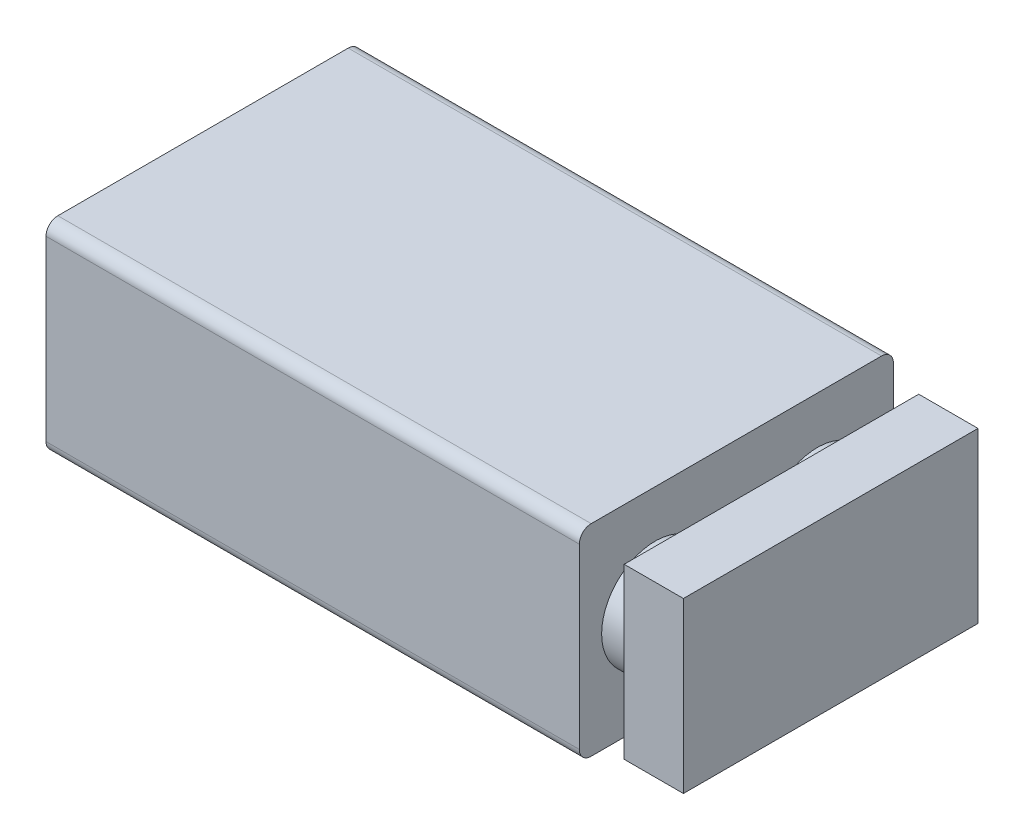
ISO-10303-21;
HEADER;
FILE_DESCRIPTION(('STEP AP214'),'2;1');
FILE_NAME('part.step','',(''),(''),'','','');
FILE_SCHEMA(('AUTOMOTIVE_DESIGN { 1 0 10303 214 1 1 1 1 }'));
ENDSEC;
DATA;
#1=APPLICATION_CONTEXT('core data for automotive mechanical design processes');
#2=APPLICATION_PROTOCOL_DEFINITION('international standard','automotive_design',2000,#1);
#3=PRODUCT_CONTEXT('',#1,'mechanical');
#4=PRODUCT('Part','Part','',(#3));
#5=PRODUCT_RELATED_PRODUCT_CATEGORY('part','',(#4));
#6=PRODUCT_DEFINITION_FORMATION('','',#4);
#7=PRODUCT_DEFINITION_CONTEXT('part definition',#1,'design');
#8=PRODUCT_DEFINITION('design','',#6,#7);
#9=PRODUCT_DEFINITION_SHAPE('','',#8);
#10=(LENGTH_UNIT() NAMED_UNIT(*) SI_UNIT(.MILLI.,.METRE.));
#11=(NAMED_UNIT(*) PLANE_ANGLE_UNIT() SI_UNIT($,.RADIAN.));
#12=(NAMED_UNIT(*) SI_UNIT($,.STERADIAN.) SOLID_ANGLE_UNIT());
#13=UNCERTAINTY_MEASURE_WITH_UNIT(LENGTH_MEASURE(1.E-05),#10,'distance_accuracy_value','');
#14=(GEOMETRIC_REPRESENTATION_CONTEXT(3) GLOBAL_UNCERTAINTY_ASSIGNED_CONTEXT((#13)) GLOBAL_UNIT_ASSIGNED_CONTEXT((#10,
#11,#12)) REPRESENTATION_CONTEXT('',''));
#15=CARTESIAN_POINT('',(0.,0.,0.));
#16=DIRECTION('',(0.,0.,1.));
#17=DIRECTION('',(1.,0.,0.));
#18=AXIS2_PLACEMENT_3D('',#15,#16,#17);
#19=CARTESIAN_POINT('',(0.,0.,26.5));
#20=DIRECTION('',(1.,0.,0.));
#21=DIRECTION('',(0.,0.,-1.));
#22=AXIS2_PLACEMENT_3D('',#19,#20,#21);
#23=PLANE('',#22);
#24=DIRECTION('',(0.,0.,-1.));
#25=VECTOR('',#24,1.);
#26=CARTESIAN_POINT('',(0.,17.,26.5));
#27=LINE('',#26,#25);
#28=CARTESIAN_POINT('',(0.,17.,25.5));
#29=VERTEX_POINT('',#28);
#30=CARTESIAN_POINT('',(0.,17.,1.));
#31=VERTEX_POINT('',#30);
#32=EDGE_CURVE('E168',#29,#31,#27,.T.);
#33=ORIENTED_EDGE('',*,*,#32,.T.);
#34=CARTESIAN_POINT('',(0.,16.,1.));
#35=DIRECTION('',(1.,0.,0.));
#36=DIRECTION('',(0.,0.,-1.));
#37=AXIS2_PLACEMENT_3D('',#34,#35,#36);
#38=CIRCLE('',#37,1.);
#39=CARTESIAN_POINT('',(0.,16.,0.));
#40=VERTEX_POINT('',#39);
#41=EDGE_CURVE('E200',#31,#40,#38,.F.);
#42=ORIENTED_EDGE('',*,*,#41,.T.);
#43=DIRECTION('',(0.,-1.,0.));
#44=VECTOR('',#43,1.);
#45=CARTESIAN_POINT('',(0.,0.,0.));
#46=LINE('',#45,#44);
#47=CARTESIAN_POINT('',(0.,1.,0.));
#48=VERTEX_POINT('',#47);
#49=EDGE_CURVE('E160',#40,#48,#46,.T.);
#50=ORIENTED_EDGE('',*,*,#49,.T.);
#51=CARTESIAN_POINT('',(0.,1.,1.));
#52=DIRECTION('',(1.,0.,0.));
#53=DIRECTION('',(0.,0.,-1.));
#54=AXIS2_PLACEMENT_3D('',#51,#52,#53);
#55=CIRCLE('',#54,1.);
#56=CARTESIAN_POINT('',(0.,0.,1.));
#57=VERTEX_POINT('',#56);
#58=EDGE_CURVE('E198',#48,#57,#55,.F.);
#59=ORIENTED_EDGE('',*,*,#58,.T.);
#60=DIRECTION('',(0.,0.,-1.));
#61=VECTOR('',#60,1.);
#62=CARTESIAN_POINT('',(0.,0.,26.5));
#63=LINE('',#62,#61);
#64=CARTESIAN_POINT('',(0.,0.,25.5));
#65=VERTEX_POINT('',#64);
#66=EDGE_CURVE('E180',#65,#57,#63,.T.);
#67=ORIENTED_EDGE('',*,*,#66,.F.);
#68=CARTESIAN_POINT('',(0.,1.,25.5));
#69=DIRECTION('',(1.,0.,0.));
#70=DIRECTION('',(0.,0.,-1.));
#71=AXIS2_PLACEMENT_3D('',#68,#69,#70);
#72=CIRCLE('',#71,1.);
#73=CARTESIAN_POINT('',(0.,1.,26.5));
#74=VERTEX_POINT('',#73);
#75=EDGE_CURVE('E194',#65,#74,#72,.F.);
#76=ORIENTED_EDGE('',*,*,#75,.T.);
#77=DIRECTION('',(0.,-1.,0.));
#78=VECTOR('',#77,1.);
#79=CARTESIAN_POINT('',(0.,0.,26.5));
#80=LINE('',#79,#78);
#81=CARTESIAN_POINT('',(0.,16.,26.5));
#82=VERTEX_POINT('',#81);
#83=EDGE_CURVE('E161',#82,#74,#80,.T.);
#84=ORIENTED_EDGE('',*,*,#83,.F.);
#85=CARTESIAN_POINT('',(0.,16.,25.5));
#86=DIRECTION('',(1.,0.,0.));
#87=DIRECTION('',(0.,0.,-1.));
#88=AXIS2_PLACEMENT_3D('',#85,#86,#87);
#89=CIRCLE('',#88,1.);
#90=EDGE_CURVE('E196',#82,#29,#89,.F.);
#91=ORIENTED_EDGE('',*,*,#90,.T.);
#92=EDGE_LOOP('',(#33,#42,#50,#59,#67,#76,#84,#91));
#93=FACE_BOUND('',#92,.T.);
#94=ADVANCED_FACE('F33',(#93),#23,.F.);
#95=CARTESIAN_POINT('',(0.,0.,26.5));
#96=DIRECTION('',(0.,1.,0.));
#97=DIRECTION('',(0.,0.,1.));
#98=AXIS2_PLACEMENT_3D('',#95,#96,#97);
#99=PLANE('',#98);
#100=ORIENTED_EDGE('',*,*,#66,.T.);
#101=DIRECTION('',(1.,0.,0.));
#102=VECTOR('',#101,1.);
#103=CARTESIAN_POINT('',(45.,0.,1.));
#104=LINE('',#103,#102);
#105=CARTESIAN_POINT('',(45.,0.,1.));
#106=VERTEX_POINT('',#105);
#107=EDGE_CURVE('E214',#57,#106,#104,.T.);
#108=ORIENTED_EDGE('',*,*,#107,.T.);
#109=DIRECTION('',(0.,0.,-1.));
#110=VECTOR('',#109,1.);
#111=CARTESIAN_POINT('',(45.,0.,26.5));
#112=LINE('',#111,#110);
#113=CARTESIAN_POINT('',(45.,0.,25.5));
#114=VERTEX_POINT('',#113);
#115=EDGE_CURVE('E178',#114,#106,#112,.T.);
#116=ORIENTED_EDGE('',*,*,#115,.F.);
#117=DIRECTION('',(1.,0.,0.));
#118=VECTOR('',#117,1.);
#119=CARTESIAN_POINT('',(0.,0.,25.5));
#120=LINE('',#119,#118);
#121=EDGE_CURVE('E212',#114,#65,#120,.F.);
#122=ORIENTED_EDGE('',*,*,#121,.T.);
#123=EDGE_LOOP('',(#100,#108,#116,#122));
#124=FACE_BOUND('',#123,.T.);
#125=ADVANCED_FACE('F234',(#124),#99,.F.);
#126=CARTESIAN_POINT('',(45.,0.,26.5));
#127=DIRECTION('',(-1.,0.,0.));
#128=DIRECTION('',(0.,0.,1.));
#129=AXIS2_PLACEMENT_3D('',#126,#127,#128);
#130=PLANE('',#129);
#131=CARTESIAN_POINT('',(45.,8.5,6.40499226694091));
#132=DIRECTION('',(-1.,0.,0.));
#133=DIRECTION('',(0.,0.,1.));
#134=AXIS2_PLACEMENT_3D('',#131,#132,#133);
#135=CIRCLE('',#134,4.52298364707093);
#136=CARTESIAN_POINT('',(45.,8.5,10.9279759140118));
#137=VERTEX_POINT('',#136);
#138=EDGE_CURVE('E186',#137,#137,#135,.F.);
#139=ORIENTED_EDGE('',*,*,#138,.F.);
#140=EDGE_LOOP('',(#139));
#141=FACE_BOUND('',#140,.T.);
#142=CARTESIAN_POINT('',(45.,8.5,20.0950077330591));
#143=DIRECTION('',(-1.,0.,0.));
#144=DIRECTION('',(0.,0.,1.));
#145=AXIS2_PLACEMENT_3D('',#142,#143,#144);
#146=CIRCLE('',#145,4.52298364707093);
#147=CARTESIAN_POINT('',(45.,8.5,24.61799138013));
#148=VERTEX_POINT('',#147);
#149=EDGE_CURVE('E183',#148,#148,#146,.F.);
#150=ORIENTED_EDGE('',*,*,#149,.F.);
#151=EDGE_LOOP('',(#150));
#152=FACE_BOUND('',#151,.T.);
#153=DIRECTION('',(0.,1.,0.));
#154=VECTOR('',#153,1.);
#155=CARTESIAN_POINT('',(45.,0.,0.));
#156=LINE('',#155,#154);
#157=CARTESIAN_POINT('',(45.,1.,0.));
#158=VERTEX_POINT('',#157);
#159=CARTESIAN_POINT('',(45.,16.,0.));
#160=VERTEX_POINT('',#159);
#161=EDGE_CURVE('E165',#158,#160,#156,.T.);
#162=ORIENTED_EDGE('',*,*,#161,.T.);
#163=CARTESIAN_POINT('',(45.,16.,1.));
#164=DIRECTION('',(-1.,0.,0.));
#165=DIRECTION('',(0.,0.,1.));
#166=AXIS2_PLACEMENT_3D('',#163,#164,#165);
#167=CIRCLE('',#166,1.);
#168=CARTESIAN_POINT('',(45.,17.,1.));
#169=VERTEX_POINT('',#168);
#170=EDGE_CURVE('E210',#160,#169,#167,.F.);
#171=ORIENTED_EDGE('',*,*,#170,.T.);
#172=DIRECTION('',(0.,0.,-1.));
#173=VECTOR('',#172,1.);
#174=CARTESIAN_POINT('',(45.,17.,26.5));
#175=LINE('',#174,#173);
#176=CARTESIAN_POINT('',(45.,17.,25.5));
#177=VERTEX_POINT('',#176);
#178=EDGE_CURVE('E175',#177,#169,#175,.T.);
#179=ORIENTED_EDGE('',*,*,#178,.F.);
#180=CARTESIAN_POINT('',(45.,16.,25.5));
#181=DIRECTION('',(-1.,0.,0.));
#182=DIRECTION('',(0.,0.,1.));
#183=AXIS2_PLACEMENT_3D('',#180,#181,#182);
#184=CIRCLE('',#183,1.);
#185=CARTESIAN_POINT('',(45.,16.,26.5));
#186=VERTEX_POINT('',#185);
#187=EDGE_CURVE('E207',#177,#186,#184,.F.);
#188=ORIENTED_EDGE('',*,*,#187,.T.);
#189=DIRECTION('',(0.,1.,0.));
#190=VECTOR('',#189,1.);
#191=CARTESIAN_POINT('',(45.,0.,26.5));
#192=LINE('',#191,#190);
#193=CARTESIAN_POINT('',(45.,1.,26.5));
#194=VERTEX_POINT('',#193);
#195=EDGE_CURVE('E164',#194,#186,#192,.T.);
#196=ORIENTED_EDGE('',*,*,#195,.F.);
#197=CARTESIAN_POINT('',(45.,1.,25.5));
#198=DIRECTION('',(-1.,0.,0.));
#199=DIRECTION('',(0.,0.,1.));
#200=AXIS2_PLACEMENT_3D('',#197,#198,#199);
#201=CIRCLE('',#200,1.);
#202=EDGE_CURVE('E56',#194,#114,#201,.F.);
#203=ORIENTED_EDGE('',*,*,#202,.T.);
#204=ORIENTED_EDGE('',*,*,#115,.T.);
#205=CARTESIAN_POINT('',(45.,1.,1.));
#206=DIRECTION('',(-1.,0.,0.));
#207=DIRECTION('',(0.,0.,1.));
#208=AXIS2_PLACEMENT_3D('',#205,#206,#207);
#209=CIRCLE('',#208,1.);
#210=EDGE_CURVE('E48',#106,#158,#209,.F.);
#211=ORIENTED_EDGE('',*,*,#210,.T.);
#212=EDGE_LOOP('',(#162,#171,#179,#188,#196,#203,#204,#211));
#213=FACE_BOUND('',#212,.T.);
#214=ADVANCED_FACE('F223',(#141,#152,#213),#130,.F.);
#215=CARTESIAN_POINT('',(0.,17.,26.5));
#216=DIRECTION('',(0.,-1.,0.));
#217=DIRECTION('',(0.,0.,-1.));
#218=AXIS2_PLACEMENT_3D('',#215,#216,#217);
#219=PLANE('',#218);
#220=ORIENTED_EDGE('',*,*,#178,.T.);
#221=DIRECTION('',(-1.,0.,0.));
#222=VECTOR('',#221,1.);
#223=CARTESIAN_POINT('',(0.,17.,1.));
#224=LINE('',#223,#222);
#225=EDGE_CURVE('E191',#169,#31,#224,.T.);
#226=ORIENTED_EDGE('',*,*,#225,.T.);
#227=ORIENTED_EDGE('',*,*,#32,.F.);
#228=DIRECTION('',(-1.,0.,0.));
#229=VECTOR('',#228,1.);
#230=CARTESIAN_POINT('',(0.,17.,25.5));
#231=LINE('',#230,#229);
#232=EDGE_CURVE('E189',#29,#177,#231,.F.);
#233=ORIENTED_EDGE('',*,*,#232,.T.);
#234=EDGE_LOOP('',(#220,#226,#227,#233));
#235=FACE_BOUND('',#234,.T.);
#236=ADVANCED_FACE('F247',(#235),#219,.F.);
#237=CARTESIAN_POINT('',(0.,0.,26.5));
#238=DIRECTION('',(0.,0.,-1.));
#239=DIRECTION('',(-1.,0.,0.));
#240=AXIS2_PLACEMENT_3D('',#237,#238,#239);
#241=PLANE('',#240);
#242=ORIENTED_EDGE('',*,*,#195,.T.);
#243=DIRECTION('',(-1.,0.,0.));
#244=VECTOR('',#243,1.);
#245=CARTESIAN_POINT('',(0.,16.,26.5));
#246=LINE('',#245,#244);
#247=EDGE_CURVE('E11',#186,#82,#246,.T.);
#248=ORIENTED_EDGE('',*,*,#247,.T.);
#249=ORIENTED_EDGE('',*,*,#83,.T.);
#250=DIRECTION('',(1.,0.,0.));
#251=VECTOR('',#250,1.);
#252=CARTESIAN_POINT('',(0.,1.,26.5));
#253=LINE('',#252,#251);
#254=EDGE_CURVE('E41',#74,#194,#253,.T.);
#255=ORIENTED_EDGE('',*,*,#254,.T.);
#256=EDGE_LOOP('',(#242,#248,#249,#255));
#257=FACE_BOUND('',#256,.T.);
#258=ADVANCED_FACE('F218',(#257),#241,.F.);
#259=CARTESIAN_POINT('',(0.,0.,0.));
#260=DIRECTION('',(0.,0.,-1.));
#261=DIRECTION('',(-1.,0.,0.));
#262=AXIS2_PLACEMENT_3D('',#259,#260,#261);
#263=PLANE('',#262);
#264=ORIENTED_EDGE('',*,*,#49,.F.);
#265=DIRECTION('',(-1.,0.,0.));
#266=VECTOR('',#265,1.);
#267=CARTESIAN_POINT('',(45.,16.,0.));
#268=LINE('',#267,#266);
#269=EDGE_CURVE('E204',#40,#160,#268,.F.);
#270=ORIENTED_EDGE('',*,*,#269,.T.);
#271=ORIENTED_EDGE('',*,*,#161,.F.);
#272=DIRECTION('',(1.,0.,0.));
#273=VECTOR('',#272,1.);
#274=CARTESIAN_POINT('',(0.,1.,0.));
#275=LINE('',#274,#273);
#276=EDGE_CURVE('E202',#158,#48,#275,.F.);
#277=ORIENTED_EDGE('',*,*,#276,.T.);
#278=EDGE_LOOP('',(#264,#270,#271,#277));
#279=FACE_BOUND('',#278,.T.);
#280=ADVANCED_FACE('F239',(#279),#263,.T.);
#281=CARTESIAN_POINT('',(48.,8.5,20.0950077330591));
#282=DIRECTION('',(-1.,0.,0.));
#283=DIRECTION('',(0.,0.,1.));
#284=AXIS2_PLACEMENT_3D('',#281,#282,#283);
#285=CYLINDRICAL_SURFACE('',#284,4.52298364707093);
#286=CARTESIAN_POINT('',(48.,8.5,20.0950077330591));
#287=DIRECTION('',(1.,0.,0.));
#288=DIRECTION('',(0.,0.,-1.));
#289=AXIS2_PLACEMENT_3D('',#286,#287,#288);
#290=CIRCLE('',#289,4.52298364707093);
#291=CARTESIAN_POINT('',(48.,8.5,15.5720240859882));
#292=VERTEX_POINT('',#291);
#293=EDGE_CURVE('E152',#292,#292,#290,.T.);
#294=ORIENTED_EDGE('',*,*,#293,.F.);
#295=EDGE_LOOP('',(#294));
#296=FACE_BOUND('',#295,.T.);
#297=ORIENTED_EDGE('',*,*,#149,.T.);
#298=EDGE_LOOP('',(#297));
#299=FACE_BOUND('',#298,.T.);
#300=ADVANCED_FACE('F287',(#296,#299),#285,.T.);
#301=CARTESIAN_POINT('',(48.,8.5,6.40499226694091));
#302=DIRECTION('',(-1.,0.,0.));
#303=DIRECTION('',(0.,0.,1.));
#304=AXIS2_PLACEMENT_3D('',#301,#302,#303);
#305=CYLINDRICAL_SURFACE('',#304,4.52298364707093);
#306=CARTESIAN_POINT('',(48.,8.5,6.40499226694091));
#307=DIRECTION('',(1.,0.,0.));
#308=DIRECTION('',(0.,0.,1.));
#309=AXIS2_PLACEMENT_3D('',#306,#307,#308);
#310=CIRCLE('',#309,4.52298364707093);
#311=CARTESIAN_POINT('',(48.,8.5,10.9279759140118));
#312=VERTEX_POINT('',#311);
#313=EDGE_CURVE('E149',#312,#312,#310,.T.);
#314=ORIENTED_EDGE('',*,*,#313,.F.);
#315=EDGE_LOOP('',(#314));
#316=FACE_BOUND('',#315,.T.);
#317=ORIENTED_EDGE('',*,*,#138,.T.);
#318=EDGE_LOOP('',(#317));
#319=FACE_BOUND('',#318,.T.);
#320=ADVANCED_FACE('F268',(#316,#319),#305,.T.);
#321=CARTESIAN_POINT('',(0.,16.,1.));
#322=DIRECTION('',(1.,0.,0.));
#323=DIRECTION('',(0.,0.,-1.));
#324=AXIS2_PLACEMENT_3D('',#321,#322,#323);
#325=CYLINDRICAL_SURFACE('',#324,1.);
#326=ORIENTED_EDGE('',*,*,#170,.F.);
#327=ORIENTED_EDGE('',*,*,#269,.F.);
#328=ORIENTED_EDGE('',*,*,#41,.F.);
#329=ORIENTED_EDGE('',*,*,#225,.F.);
#330=EDGE_LOOP('',(#326,#327,#328,#329));
#331=FACE_BOUND('',#330,.T.);
#332=ADVANCED_FACE('F244',(#331),#325,.T.);
#333=CARTESIAN_POINT('',(0.,1.,1.));
#334=DIRECTION('',(-1.,0.,0.));
#335=DIRECTION('',(0.,0.,1.));
#336=AXIS2_PLACEMENT_3D('',#333,#334,#335);
#337=CYLINDRICAL_SURFACE('',#336,1.);
#338=ORIENTED_EDGE('',*,*,#58,.F.);
#339=ORIENTED_EDGE('',*,*,#276,.F.);
#340=ORIENTED_EDGE('',*,*,#210,.F.);
#341=ORIENTED_EDGE('',*,*,#107,.F.);
#342=EDGE_LOOP('',(#338,#339,#340,#341));
#343=FACE_BOUND('',#342,.T.);
#344=ADVANCED_FACE('F242',(#343),#337,.T.);
#345=CARTESIAN_POINT('',(0.,16.,25.5));
#346=DIRECTION('',(-1.,0.,0.));
#347=DIRECTION('',(0.,0.,1.));
#348=AXIS2_PLACEMENT_3D('',#345,#346,#347);
#349=CYLINDRICAL_SURFACE('',#348,1.);
#350=ORIENTED_EDGE('',*,*,#187,.F.);
#351=ORIENTED_EDGE('',*,*,#232,.F.);
#352=ORIENTED_EDGE('',*,*,#90,.F.);
#353=ORIENTED_EDGE('',*,*,#247,.F.);
#354=EDGE_LOOP('',(#350,#351,#352,#353));
#355=FACE_BOUND('',#354,.T.);
#356=ADVANCED_FACE('F228',(#355),#349,.T.);
#357=CARTESIAN_POINT('',(0.,1.,25.5));
#358=DIRECTION('',(1.,0.,0.));
#359=DIRECTION('',(0.,0.,-1.));
#360=AXIS2_PLACEMENT_3D('',#357,#358,#359);
#361=CYLINDRICAL_SURFACE('',#360,1.);
#362=ORIENTED_EDGE('',*,*,#75,.F.);
#363=ORIENTED_EDGE('',*,*,#121,.F.);
#364=ORIENTED_EDGE('',*,*,#202,.F.);
#365=ORIENTED_EDGE('',*,*,#254,.F.);
#366=EDGE_LOOP('',(#362,#363,#364,#365));
#367=FACE_BOUND('',#366,.T.);
#368=ADVANCED_FACE('F35',(#367),#361,.T.);
#369=CARTESIAN_POINT('',(53.,15.6395911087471,25.7178415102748));
#370=DIRECTION('',(0.,0.,-1.));
#371=DIRECTION('',(-1.,0.,0.));
#372=AXIS2_PLACEMENT_3D('',#369,#370,#371);
#373=PLANE('',#372);
#374=DIRECTION('',(0.,-1.,0.));
#375=VECTOR('',#374,1.);
#376=CARTESIAN_POINT('',(48.,15.6395911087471,25.7178415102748));
#377=LINE('',#376,#375);
#378=CARTESIAN_POINT('',(48.,15.6395911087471,25.7178415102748));
#379=VERTEX_POINT('',#378);
#380=CARTESIAN_POINT('',(48.,1.38685182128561,25.7178415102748));
#381=VERTEX_POINT('',#380);
#382=EDGE_CURVE('E148',#379,#381,#377,.T.);
#383=ORIENTED_EDGE('',*,*,#382,.T.);
#384=DIRECTION('',(-1.,0.,0.));
#385=VECTOR('',#384,1.);
#386=CARTESIAN_POINT('',(53.,1.38685182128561,25.7178415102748));
#387=LINE('',#386,#385);
#388=CARTESIAN_POINT('',(53.,1.38685182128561,25.7178415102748));
#389=VERTEX_POINT('',#388);
#390=EDGE_CURVE('E128',#389,#381,#387,.T.);
#391=ORIENTED_EDGE('',*,*,#390,.F.);
#392=DIRECTION('',(0.,-1.,0.));
#393=VECTOR('',#392,1.);
#394=CARTESIAN_POINT('',(53.,15.6395911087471,25.7178415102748));
#395=LINE('',#394,#393);
#396=CARTESIAN_POINT('',(53.,15.6395911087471,25.7178415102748));
#397=VERTEX_POINT('',#396);
#398=EDGE_CURVE('E135',#397,#389,#395,.T.);
#399=ORIENTED_EDGE('',*,*,#398,.F.);
#400=DIRECTION('',(-1.,0.,0.));
#401=VECTOR('',#400,1.);
#402=CARTESIAN_POINT('',(53.,15.6395911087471,25.7178415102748));
#403=LINE('',#402,#401);
#404=EDGE_CURVE('E380',#397,#379,#403,.T.);
#405=ORIENTED_EDGE('',*,*,#404,.T.);
#406=EDGE_LOOP('',(#383,#391,#399,#405));
#407=FACE_BOUND('',#406,.T.);
#408=ADVANCED_FACE('F146',(#407),#373,.F.);
#409=CARTESIAN_POINT('',(53.,1.38685182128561,25.7178415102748));
#410=DIRECTION('',(0.,1.,0.));
#411=DIRECTION('',(0.,0.,1.));
#412=AXIS2_PLACEMENT_3D('',#409,#410,#411);
#413=PLANE('',#412);
#414=DIRECTION('',(0.,0.,-1.));
#415=VECTOR('',#414,1.);
#416=CARTESIAN_POINT('',(48.,1.38685182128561,25.7178415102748));
#417=LINE('',#416,#415);
#418=CARTESIAN_POINT('',(48.,1.38685182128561,0.861487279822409));
#419=VERTEX_POINT('',#418);
#420=EDGE_CURVE('E371',#381,#419,#417,.T.);
#421=ORIENTED_EDGE('',*,*,#420,.T.);
#422=DIRECTION('',(-1.,0.,0.));
#423=VECTOR('',#422,1.);
#424=CARTESIAN_POINT('',(53.,1.38685182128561,0.861487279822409));
#425=LINE('',#424,#423);
#426=CARTESIAN_POINT('',(53.,1.38685182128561,0.861487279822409));
#427=VERTEX_POINT('',#426);
#428=EDGE_CURVE('E131',#427,#419,#425,.T.);
#429=ORIENTED_EDGE('',*,*,#428,.F.);
#430=DIRECTION('',(0.,0.,-1.));
#431=VECTOR('',#430,1.);
#432=CARTESIAN_POINT('',(53.,1.38685182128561,25.7178415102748));
#433=LINE('',#432,#431);
#434=EDGE_CURVE('E124',#389,#427,#433,.T.);
#435=ORIENTED_EDGE('',*,*,#434,.F.);
#436=ORIENTED_EDGE('',*,*,#390,.T.);
#437=EDGE_LOOP('',(#421,#429,#435,#436));
#438=FACE_BOUND('',#437,.T.);
#439=ADVANCED_FACE('F126',(#438),#413,.F.);
#440=CARTESIAN_POINT('',(53.,15.6395911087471,0.861487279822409));
#441=DIRECTION('',(0.,0.,1.));
#442=DIRECTION('',(1.,0.,0.));
#443=AXIS2_PLACEMENT_3D('',#440,#441,#442);
#444=PLANE('',#443);
#445=DIRECTION('',(0.,1.,0.));
#446=VECTOR('',#445,1.);
#447=CARTESIAN_POINT('',(48.,15.6395911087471,0.861487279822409));
#448=LINE('',#447,#446);
#449=CARTESIAN_POINT('',(48.,15.6395911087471,0.861487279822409));
#450=VERTEX_POINT('',#449);
#451=EDGE_CURVE('E373',#419,#450,#448,.T.);
#452=ORIENTED_EDGE('',*,*,#451,.T.);
#453=DIRECTION('',(-1.,0.,0.));
#454=VECTOR('',#453,1.);
#455=CARTESIAN_POINT('',(53.,15.6395911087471,0.861487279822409));
#456=LINE('',#455,#454);
#457=CARTESIAN_POINT('',(53.,15.6395911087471,0.861487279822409));
#458=VERTEX_POINT('',#457);
#459=EDGE_CURVE('E154',#458,#450,#456,.T.);
#460=ORIENTED_EDGE('',*,*,#459,.F.);
#461=DIRECTION('',(0.,1.,0.));
#462=VECTOR('',#461,1.);
#463=CARTESIAN_POINT('',(53.,15.6395911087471,0.861487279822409));
#464=LINE('',#463,#462);
#465=EDGE_CURVE('E134',#427,#458,#464,.T.);
#466=ORIENTED_EDGE('',*,*,#465,.F.);
#467=ORIENTED_EDGE('',*,*,#428,.T.);
#468=EDGE_LOOP('',(#452,#460,#466,#467));
#469=FACE_BOUND('',#468,.T.);
#470=ADVANCED_FACE('F281',(#469),#444,.F.);
#471=CARTESIAN_POINT('',(53.,15.6395911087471,25.7178415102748));
#472=DIRECTION('',(0.,-1.,0.));
#473=DIRECTION('',(0.,0.,-1.));
#474=AXIS2_PLACEMENT_3D('',#471,#472,#473);
#475=PLANE('',#474);
#476=DIRECTION('',(0.,0.,1.));
#477=VECTOR('',#476,1.);
#478=CARTESIAN_POINT('',(48.,15.6395911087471,25.7178415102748));
#479=LINE('',#478,#477);
#480=EDGE_CURVE('E144',#450,#379,#479,.T.);
#481=ORIENTED_EDGE('',*,*,#480,.T.);
#482=ORIENTED_EDGE('',*,*,#404,.F.);
#483=DIRECTION('',(0.,0.,1.));
#484=VECTOR('',#483,1.);
#485=CARTESIAN_POINT('',(53.,15.6395911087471,25.7178415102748));
#486=LINE('',#485,#484);
#487=EDGE_CURVE('E140',#458,#397,#486,.T.);
#488=ORIENTED_EDGE('',*,*,#487,.F.);
#489=ORIENTED_EDGE('',*,*,#459,.T.);
#490=EDGE_LOOP('',(#481,#482,#488,#489));
#491=FACE_BOUND('',#490,.T.);
#492=ADVANCED_FACE('F334',(#491),#475,.F.);
#493=CARTESIAN_POINT('',(53.,0.,0.));
#494=DIRECTION('',(1.,0.,0.));
#495=DIRECTION('',(0.,0.,-1.));
#496=AXIS2_PLACEMENT_3D('',#493,#494,#495);
#497=PLANE('',#496);
#498=ORIENTED_EDGE('',*,*,#398,.T.);
#499=ORIENTED_EDGE('',*,*,#434,.T.);
#500=ORIENTED_EDGE('',*,*,#465,.T.);
#501=ORIENTED_EDGE('',*,*,#487,.T.);
#502=EDGE_LOOP('',(#498,#499,#500,#501));
#503=FACE_BOUND('',#502,.T.);
#504=ADVANCED_FACE('F138',(#503),#497,.T.);
#505=CARTESIAN_POINT('',(48.,0.,0.));
#506=DIRECTION('',(1.,0.,0.));
#507=DIRECTION('',(0.,0.,-1.));
#508=AXIS2_PLACEMENT_3D('',#505,#506,#507);
#509=PLANE('',#508);
#510=ORIENTED_EDGE('',*,*,#293,.T.);
#511=EDGE_LOOP('',(#510));
#512=FACE_BOUND('',#511,.T.);
#513=ORIENTED_EDGE('',*,*,#313,.T.);
#514=EDGE_LOOP('',(#513));
#515=FACE_BOUND('',#514,.T.);
#516=ORIENTED_EDGE('',*,*,#382,.F.);
#517=ORIENTED_EDGE('',*,*,#480,.F.);
#518=ORIENTED_EDGE('',*,*,#451,.F.);
#519=ORIENTED_EDGE('',*,*,#420,.F.);
#520=EDGE_LOOP('',(#516,#517,#518,#519));
#521=FACE_BOUND('',#520,.T.);
#522=ADVANCED_FACE('F352',(#512,#515,#521),#509,.F.);
#523=CLOSED_SHELL('',(#94,#125,#214,#236,#258,#280,#300,#320,#332,#344,#356,#368,#408,#439,#470,
#492,#504,#522));
#524=MANIFOLD_SOLID_BREP('B2',#523);
#525=ADVANCED_BREP_SHAPE_REPRESENTATION('',(#18,#524),#14);
#526=SHAPE_DEFINITION_REPRESENTATION(#9,#525);
ENDSEC;
END-ISO-10303-21;
